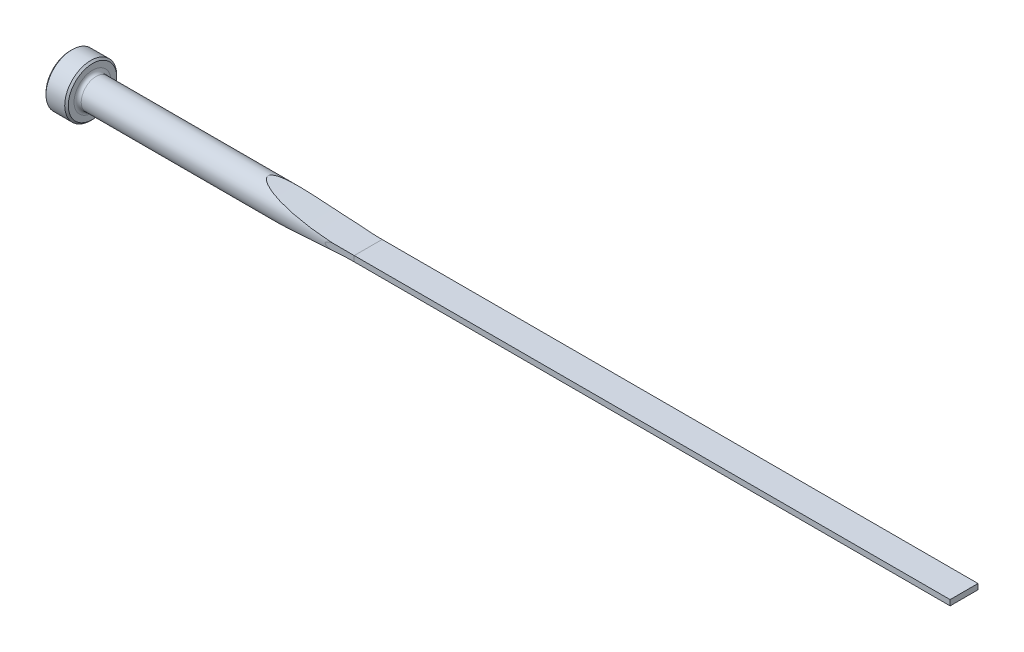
from build123d import *

# Parameters (mm, degrees)
CUT_EXTRUDE1_DEPTH = 191.661618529
CUT_EXTRUDE2_DEPTH = 191.661618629
FILLET1_R          = 0.762
CHAMFER1_SIZE      = 0.381


with BuildPart() as part:
    # Sketch1 → Revolve1 (revolve)
    with BuildSketch(Plane.XY, mode=Mode.PRIVATE) as revolve1_sk:
        Polygon((0, 0), (0, 5.5499), (4.7498, 5.5499), (4.7498, 3.175), (190.5, 3.175), (190.5, 0), align=None)
    revolve(revolve1_sk.sketch.rotate(Axis((0, 0, 0), (1, 0, 0)), 90), axis=Axis((0, 0, 0), (1, 0, 0)))

    # Sketch2 → Cut-Extrude1 (cut, symmetric)
    with BuildSketch(Plane.XY):
        with BuildLine():
            Line((190.5, 3.175), (190.5, 0.5842))
            Line((190.5, 0.5842), (63.5, 0.5842))
            ThreePointArc((63.5, 0.5842), (52.768687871, 1.234276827), (42.194320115, 3.175))
            Line((42.194320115, 3.175), (190.5, 3.175))
        make_face()
    cut_extrude1 = extrude(amount=CUT_EXTRUDE1_DEPTH, both=True, mode=Mode.SUBTRACT)

    # Mirror1: Cut-Extrude1 across plane
    add(cut_extrude1.mirror(Plane.ZX), mode=Mode.SUBTRACT)

    # Sketch3 → Cut-Extrude2 (cut, symmetric)
    with BuildSketch(Plane(origin=(0, 0, 0), x_dir=(1, 0, 0), z_dir=(0, 1, 0))):
        with BuildLine():
            Line((190.5, 3.175), (190.5, 2.9718))
            Line((190.5, 2.9718), (63.5, 2.9718))
            ThreePointArc((63.5, 2.9718), (60.49463147, 3.022614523), (57.492698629, 3.175))
            Line((57.492698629, 3.175), (190.5, 3.175))
        make_face()
    cut_extrude2 = extrude(amount=CUT_EXTRUDE2_DEPTH, both=True, mode=Mode.SUBTRACT)

    # Mirror2: Cut-Extrude2 across plane
    add(cut_extrude2.mirror(Plane.XY), mode=Mode.SUBTRACT)

    # Fillet1
    fillet1_edges = [part.edges().sort_by_distance(p)[0] for p in [
        (4.7498, 0, -3.175),
    ]]
    fillet(fillet1_edges, radius=FILLET1_R)

    # Chamfer1
    chamfer1_edges = [part.edges().sort_by_distance(p)[0] for p in [
        (4.7498, 0, -5.5499),
        (0, 0, -5.5499),
    ]]
    chamfer(chamfer1_edges, length=CHAMFER1_SIZE)


solid = part.part
